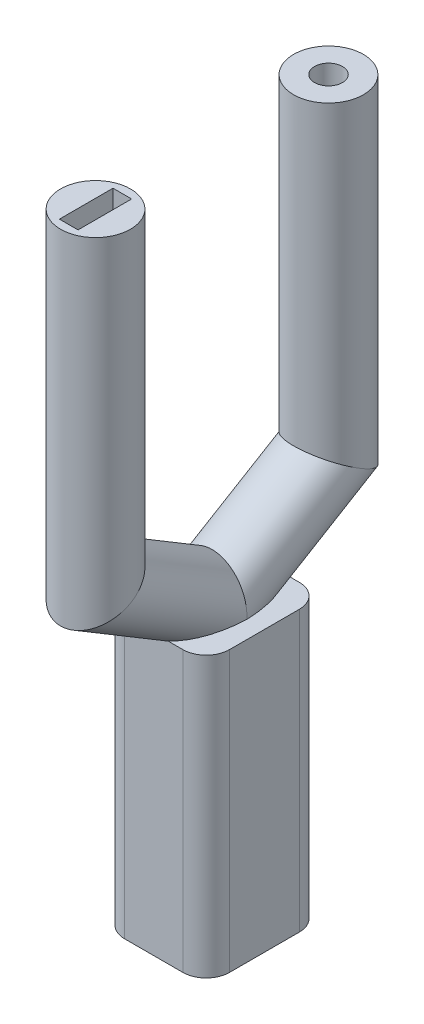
ISO-10303-21;
HEADER;
FILE_DESCRIPTION(('STEP AP214'),'2;1');
FILE_NAME('part.step','',(''),(''),'','','');
FILE_SCHEMA(('AUTOMOTIVE_DESIGN { 1 0 10303 214 1 1 1 1 }'));
ENDSEC;
DATA;
#1=APPLICATION_CONTEXT('core data for automotive mechanical design processes');
#2=APPLICATION_PROTOCOL_DEFINITION('international standard','automotive_design',2000,#1);
#3=PRODUCT_CONTEXT('',#1,'mechanical');
#4=PRODUCT('Part','Part','',(#3));
#5=PRODUCT_RELATED_PRODUCT_CATEGORY('part','',(#4));
#6=PRODUCT_DEFINITION_FORMATION('','',#4);
#7=PRODUCT_DEFINITION_CONTEXT('part definition',#1,'design');
#8=PRODUCT_DEFINITION('design','',#6,#7);
#9=PRODUCT_DEFINITION_SHAPE('','',#8);
#10=(LENGTH_UNIT() NAMED_UNIT(*) SI_UNIT(.MILLI.,.METRE.));
#11=(NAMED_UNIT(*) PLANE_ANGLE_UNIT() SI_UNIT($,.RADIAN.));
#12=(NAMED_UNIT(*) SI_UNIT($,.STERADIAN.) SOLID_ANGLE_UNIT());
#13=UNCERTAINTY_MEASURE_WITH_UNIT(LENGTH_MEASURE(1.E-05),#10,'distance_accuracy_value','');
#14=(GEOMETRIC_REPRESENTATION_CONTEXT(3) GLOBAL_UNCERTAINTY_ASSIGNED_CONTEXT((#13)) GLOBAL_UNIT_ASSIGNED_CONTEXT((#10,
#11,#12)) REPRESENTATION_CONTEXT('',''));
#15=CARTESIAN_POINT('',(0.,0.,0.));
#16=DIRECTION('',(0.,0.,1.));
#17=DIRECTION('',(1.,0.,0.));
#18=AXIS2_PLACEMENT_3D('',#15,#16,#17);
#19=CARTESIAN_POINT('',(-19.5,-290.,-25.));
#20=DIRECTION('',(1.,0.,0.));
#21=DIRECTION('',(0.,0.,-1.));
#22=AXIS2_PLACEMENT_3D('',#19,#20,#21);
#23=PLANE('',#22);
#24=DIRECTION('',(0.,1.,0.));
#25=VECTOR('',#24,1.);
#26=CARTESIAN_POINT('',(-19.5,-290.,-35.));
#27=LINE('',#26,#25);
#28=CARTESIAN_POINT('',(-19.5,-287.,-35.));
#29=VERTEX_POINT('',#28);
#30=CARTESIAN_POINT('',(-19.5,-173.,-35.));
#31=VERTEX_POINT('',#30);
#32=EDGE_CURVE('E829',#29,#31,#27,.T.);
#33=ORIENTED_EDGE('',*,*,#32,.F.);
#34=DIRECTION('',(0.,0.,-1.));
#35=VECTOR('',#34,1.);
#36=CARTESIAN_POINT('',(-19.5,-287.,-25.));
#37=LINE('',#36,#35);
#38=CARTESIAN_POINT('',(-19.5,-287.,-65.));
#39=VERTEX_POINT('',#38);
#40=EDGE_CURVE('E298',#29,#39,#37,.T.);
#41=ORIENTED_EDGE('',*,*,#40,.T.);
#42=DIRECTION('',(0.,1.,0.));
#43=VECTOR('',#42,1.);
#44=CARTESIAN_POINT('',(-19.5,-290.,-65.));
#45=LINE('',#44,#43);
#46=CARTESIAN_POINT('',(-19.5,-173.,-65.));
#47=VERTEX_POINT('',#46);
#48=EDGE_CURVE('E833',#47,#39,#45,.F.);
#49=ORIENTED_EDGE('',*,*,#48,.F.);
#50=DIRECTION('',(0.,0.,-1.));
#51=VECTOR('',#50,1.);
#52=CARTESIAN_POINT('',(-19.5,-173.,-25.));
#53=LINE('',#52,#51);
#54=EDGE_CURVE('E739',#31,#47,#53,.T.);
#55=ORIENTED_EDGE('',*,*,#54,.F.);
#56=EDGE_LOOP('',(#33,#41,#49,#55));
#57=FACE_BOUND('',#56,.T.);
#58=ADVANCED_FACE('F56',(#57),#23,.T.);
#59=CARTESIAN_POINT('',(-22.5,-290.,-72.));
#60=DIRECTION('',(0.,0.,1.));
#61=DIRECTION('',(1.,0.,0.));
#62=AXIS2_PLACEMENT_3D('',#59,#60,#61);
#63=PLANE('',#62);
#64=DIRECTION('',(0.,1.,0.));
#65=VECTOR('',#64,1.);
#66=CARTESIAN_POINT('',(-12.5,-290.,-72.));
#67=LINE('',#66,#65);
#68=CARTESIAN_POINT('',(-12.5,-287.,-72.));
#69=VERTEX_POINT('',#68);
#70=CARTESIAN_POINT('',(-12.5,-173.,-72.));
#71=VERTEX_POINT('',#70);
#72=EDGE_CURVE('E838',#69,#71,#67,.T.);
#73=ORIENTED_EDGE('',*,*,#72,.F.);
#74=DIRECTION('',(1.,0.,0.));
#75=VECTOR('',#74,1.);
#76=CARTESIAN_POINT('',(-22.5,-287.,-72.));
#77=LINE('',#76,#75);
#78=CARTESIAN_POINT('',(12.5,-287.,-72.));
#79=VERTEX_POINT('',#78);
#80=EDGE_CURVE('E74',#69,#79,#77,.T.);
#81=ORIENTED_EDGE('',*,*,#80,.T.);
#82=DIRECTION('',(0.,1.,0.));
#83=VECTOR('',#82,1.);
#84=CARTESIAN_POINT('',(12.5,-290.,-72.));
#85=LINE('',#84,#83);
#86=CARTESIAN_POINT('',(12.5,-173.,-72.));
#87=VERTEX_POINT('',#86);
#88=EDGE_CURVE('E290',#87,#79,#85,.F.);
#89=ORIENTED_EDGE('',*,*,#88,.F.);
#90=DIRECTION('',(1.,0.,0.));
#91=VECTOR('',#90,1.);
#92=CARTESIAN_POINT('',(-22.5,-173.,-72.));
#93=LINE('',#92,#91);
#94=EDGE_CURVE('E742',#71,#87,#93,.T.);
#95=ORIENTED_EDGE('',*,*,#94,.F.);
#96=EDGE_LOOP('',(#73,#81,#89,#95));
#97=FACE_BOUND('',#96,.T.);
#98=ADVANCED_FACE('F404',(#97),#63,.T.);
#99=CARTESIAN_POINT('',(19.5,-290.,-25.));
#100=DIRECTION('',(1.,0.,0.));
#101=DIRECTION('',(0.,0.,-1.));
#102=AXIS2_PLACEMENT_3D('',#99,#100,#101);
#103=PLANE('',#102);
#104=DIRECTION('',(0.,0.,-1.));
#105=VECTOR('',#104,1.);
#106=CARTESIAN_POINT('',(19.5,-287.,-25.));
#107=LINE('',#106,#105);
#108=CARTESIAN_POINT('',(19.5,-287.,-35.));
#109=VERTEX_POINT('',#108);
#110=CARTESIAN_POINT('',(19.5,-287.,-65.));
#111=VERTEX_POINT('',#110);
#112=EDGE_CURVE('E317',#109,#111,#107,.T.);
#113=ORIENTED_EDGE('',*,*,#112,.F.);
#114=DIRECTION('',(0.,1.,0.));
#115=VECTOR('',#114,1.);
#116=CARTESIAN_POINT('',(19.5,-290.,-35.));
#117=LINE('',#116,#115);
#118=CARTESIAN_POINT('',(19.5,-173.,-35.));
#119=VERTEX_POINT('',#118);
#120=EDGE_CURVE('E805',#119,#109,#117,.F.);
#121=ORIENTED_EDGE('',*,*,#120,.F.);
#122=DIRECTION('',(0.,0.,-1.));
#123=VECTOR('',#122,1.);
#124=CARTESIAN_POINT('',(19.5,-173.,-25.));
#125=LINE('',#124,#123);
#126=CARTESIAN_POINT('',(19.5,-173.,-65.));
#127=VERTEX_POINT('',#126);
#128=EDGE_CURVE('E830',#119,#127,#125,.T.);
#129=ORIENTED_EDGE('',*,*,#128,.T.);
#130=DIRECTION('',(0.,1.,0.));
#131=VECTOR('',#130,1.);
#132=CARTESIAN_POINT('',(19.5,-290.,-65.));
#133=LINE('',#132,#131);
#134=EDGE_CURVE('E860',#111,#127,#133,.T.);
#135=ORIENTED_EDGE('',*,*,#134,.F.);
#136=EDGE_LOOP('',(#113,#121,#129,#135));
#137=FACE_BOUND('',#136,.T.);
#138=ADVANCED_FACE('F410',(#137),#103,.F.);
#139=CARTESIAN_POINT('',(-22.5,-290.,-28.));
#140=DIRECTION('',(0.,0.,1.));
#141=DIRECTION('',(1.,0.,0.));
#142=AXIS2_PLACEMENT_3D('',#139,#140,#141);
#143=PLANE('',#142);
#144=DIRECTION('',(1.,0.,0.));
#145=VECTOR('',#144,1.);
#146=CARTESIAN_POINT('',(-22.5,-287.,-28.));
#147=LINE('',#146,#145);
#148=CARTESIAN_POINT('',(-12.5,-287.,-28.));
#149=VERTEX_POINT('',#148);
#150=CARTESIAN_POINT('',(12.5,-287.,-28.));
#151=VERTEX_POINT('',#150);
#152=EDGE_CURVE('E293',#149,#151,#147,.T.);
#153=ORIENTED_EDGE('',*,*,#152,.F.);
#154=DIRECTION('',(0.,1.,0.));
#155=VECTOR('',#154,1.);
#156=CARTESIAN_POINT('',(-12.5,-290.,-28.));
#157=LINE('',#156,#155);
#158=CARTESIAN_POINT('',(-12.5,-173.,-28.));
#159=VERTEX_POINT('',#158);
#160=EDGE_CURVE('E280',#159,#149,#157,.F.);
#161=ORIENTED_EDGE('',*,*,#160,.F.);
#162=DIRECTION('',(1.,0.,0.));
#163=VECTOR('',#162,1.);
#164=CARTESIAN_POINT('',(-22.5,-173.,-28.));
#165=LINE('',#164,#163);
#166=CARTESIAN_POINT('',(12.5,-173.,-28.));
#167=VERTEX_POINT('',#166);
#168=EDGE_CURVE('E813',#159,#167,#165,.T.);
#169=ORIENTED_EDGE('',*,*,#168,.T.);
#170=DIRECTION('',(0.,1.,0.));
#171=VECTOR('',#170,1.);
#172=CARTESIAN_POINT('',(12.5,-290.,-28.));
#173=LINE('',#172,#171);
#174=EDGE_CURVE('E288',#151,#167,#173,.T.);
#175=ORIENTED_EDGE('',*,*,#174,.F.);
#176=EDGE_LOOP('',(#153,#161,#169,#175));
#177=FACE_BOUND('',#176,.T.);
#178=ADVANCED_FACE('F292',(#177),#143,.F.);
#179=CARTESIAN_POINT('',(12.5,-290.,-65.));
#180=DIRECTION('',(0.,-1.,0.));
#181=DIRECTION('',(0.,0.,-1.));
#182=AXIS2_PLACEMENT_3D('',#179,#180,#181);
#183=CYLINDRICAL_SURFACE('',#182,7.);
#184=CARTESIAN_POINT('',(12.5,-287.,-65.));
#185=DIRECTION('',(0.,-1.,0.));
#186=DIRECTION('',(0.,0.,-1.));
#187=AXIS2_PLACEMENT_3D('',#184,#185,#186);
#188=CIRCLE('',#187,7.);
#189=EDGE_CURVE('E85',#111,#79,#188,.F.);
#190=ORIENTED_EDGE('',*,*,#189,.F.);
#191=ORIENTED_EDGE('',*,*,#134,.T.);
#192=CARTESIAN_POINT('',(12.5,-173.,-65.));
#193=DIRECTION('',(0.,-1.,0.));
#194=DIRECTION('',(0.,0.,-1.));
#195=AXIS2_PLACEMENT_3D('',#192,#193,#194);
#196=CIRCLE('',#195,7.);
#197=EDGE_CURVE('E841',#127,#87,#196,.F.);
#198=ORIENTED_EDGE('',*,*,#197,.T.);
#199=ORIENTED_EDGE('',*,*,#88,.T.);
#200=EDGE_LOOP('',(#190,#191,#198,#199));
#201=FACE_BOUND('',#200,.T.);
#202=ADVANCED_FACE('F412',(#201),#183,.F.);
#203=CARTESIAN_POINT('',(12.5,-290.,-35.));
#204=DIRECTION('',(0.,1.,0.));
#205=DIRECTION('',(0.,0.,1.));
#206=AXIS2_PLACEMENT_3D('',#203,#204,#205);
#207=CYLINDRICAL_SURFACE('',#206,7.);
#208=CARTESIAN_POINT('',(12.5,-287.,-35.));
#209=DIRECTION('',(0.,-1.,0.));
#210=DIRECTION('',(0.,0.,-1.));
#211=AXIS2_PLACEMENT_3D('',#208,#209,#210);
#212=CIRCLE('',#211,7.);
#213=EDGE_CURVE('E309',#151,#109,#212,.F.);
#214=ORIENTED_EDGE('',*,*,#213,.F.);
#215=ORIENTED_EDGE('',*,*,#174,.T.);
#216=CARTESIAN_POINT('',(12.5,-173.,-35.));
#217=DIRECTION('',(0.,-1.,0.));
#218=DIRECTION('',(0.,0.,-1.));
#219=AXIS2_PLACEMENT_3D('',#216,#217,#218);
#220=CIRCLE('',#219,7.);
#221=EDGE_CURVE('E855',#167,#119,#220,.F.);
#222=ORIENTED_EDGE('',*,*,#221,.T.);
#223=ORIENTED_EDGE('',*,*,#120,.T.);
#224=EDGE_LOOP('',(#214,#215,#222,#223));
#225=FACE_BOUND('',#224,.T.);
#226=ADVANCED_FACE('F418',(#225),#207,.F.);
#227=CARTESIAN_POINT('',(-12.5,-290.,-65.));
#228=DIRECTION('',(0.,1.,0.));
#229=DIRECTION('',(0.,0.,1.));
#230=AXIS2_PLACEMENT_3D('',#227,#228,#229);
#231=CYLINDRICAL_SURFACE('',#230,7.);
#232=CARTESIAN_POINT('',(-12.5,-287.,-65.));
#233=DIRECTION('',(0.,-1.,0.));
#234=DIRECTION('',(0.,0.,-1.));
#235=AXIS2_PLACEMENT_3D('',#232,#233,#234);
#236=CIRCLE('',#235,7.);
#237=EDGE_CURVE('E303',#69,#39,#236,.F.);
#238=ORIENTED_EDGE('',*,*,#237,.F.);
#239=ORIENTED_EDGE('',*,*,#72,.T.);
#240=CARTESIAN_POINT('',(-12.5,-173.,-65.));
#241=DIRECTION('',(0.,-1.,0.));
#242=DIRECTION('',(0.,0.,-1.));
#243=AXIS2_PLACEMENT_3D('',#240,#241,#242);
#244=CIRCLE('',#243,7.);
#245=EDGE_CURVE('E828',#71,#47,#244,.F.);
#246=ORIENTED_EDGE('',*,*,#245,.T.);
#247=ORIENTED_EDGE('',*,*,#48,.T.);
#248=EDGE_LOOP('',(#238,#239,#246,#247));
#249=FACE_BOUND('',#248,.T.);
#250=ADVANCED_FACE('F417',(#249),#231,.F.);
#251=CARTESIAN_POINT('',(-12.5,-290.,-35.));
#252=DIRECTION('',(0.,-1.,0.));
#253=DIRECTION('',(0.,0.,-1.));
#254=AXIS2_PLACEMENT_3D('',#251,#252,#253);
#255=CYLINDRICAL_SURFACE('',#254,7.);
#256=CARTESIAN_POINT('',(-12.5,-287.,-35.));
#257=DIRECTION('',(0.,-1.,0.));
#258=DIRECTION('',(0.,0.,-1.));
#259=AXIS2_PLACEMENT_3D('',#256,#257,#258);
#260=CIRCLE('',#259,7.);
#261=EDGE_CURVE('E12',#29,#149,#260,.F.);
#262=ORIENTED_EDGE('',*,*,#261,.F.);
#263=ORIENTED_EDGE('',*,*,#32,.T.);
#264=CARTESIAN_POINT('',(-12.5,-173.,-35.));
#265=DIRECTION('',(0.,-1.,0.));
#266=DIRECTION('',(0.,0.,-1.));
#267=AXIS2_PLACEMENT_3D('',#264,#265,#266);
#268=CIRCLE('',#267,7.);
#269=EDGE_CURVE('E285',#31,#159,#268,.F.);
#270=ORIENTED_EDGE('',*,*,#269,.T.);
#271=ORIENTED_EDGE('',*,*,#160,.T.);
#272=EDGE_LOOP('',(#262,#263,#270,#271));
#273=FACE_BOUND('',#272,.T.);
#274=ADVANCED_FACE('F279',(#273),#255,.F.);
#275=CARTESIAN_POINT('',(0.,-174.144957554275,-41.4250707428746));
#276=DIRECTION('',(0.,0.514495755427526,-0.857492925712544));
#277=DIRECTION('',(0.,0.857492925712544,0.514495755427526));
#278=AXIS2_PLACEMENT_3D('',#275,#276,#277);
#279=CYLINDRICAL_SURFACE('',#278,15.);
#280=CARTESIAN_POINT('',(0.,-139.,-100.));
#281=DIRECTION('',(0.,0.870199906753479,-0.492698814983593));
#282=DIRECTION('',(0.,-0.492698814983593,-0.870199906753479));
#283=AXIS2_PLACEMENT_3D('',#280,#281,#282);
#284=ELLIPSE('',#283,17.2374185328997,15.);
#285=CARTESIAN_POINT('',(0.,-147.492855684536,-115.));
#286=VERTEX_POINT('',#285);
#287=EDGE_CURVE('E661',#286,#286,#284,.F.);
#288=ORIENTED_EDGE('',*,*,#287,.T.);
#289=EDGE_LOOP('',(#288));
#290=FACE_BOUND('',#289,.T.);
#291=CARTESIAN_POINT('',(0.,-154.,-75.));
#292=DIRECTION('',(0.,0.,1.));
#293=DIRECTION('',(0.,1.,0.));
#294=AXIS2_PLACEMENT_3D('',#291,#292,#293);
#295=ELLIPSE('',#294,17.4928556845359,15.);
#296=CARTESIAN_POINT('',(6.06339062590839,-170.,-75.));
#297=VERTEX_POINT('',#296);
#298=CARTESIAN_POINT('',(-6.06339062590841,-170.,-75.));
#299=VERTEX_POINT('',#298);
#300=EDGE_CURVE('E682',#297,#299,#295,.F.);
#301=ORIENTED_EDGE('',*,*,#300,.T.);
#302=CARTESIAN_POINT('',(0.,-170.,-48.3333333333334));
#303=DIRECTION('',(0.,-1.,0.));
#304=DIRECTION('',(0.,0.,-1.));
#305=AXIS2_PLACEMENT_3D('',#302,#303,#304);
#306=ELLIPSE('',#305,29.1547594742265,15.);
#307=CARTESIAN_POINT('',(-14.9754701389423,-170.,-50.));
#308=VERTEX_POINT('',#307);
#309=EDGE_CURVE('E553',#299,#308,#306,.F.);
#310=ORIENTED_EDGE('',*,*,#309,.T.);
#311=CARTESIAN_POINT('',(0.,-169.,-50.));
#312=DIRECTION('',(0.,0.,-1.));
#313=DIRECTION('',(0.,-1.,0.));
#314=AXIS2_PLACEMENT_3D('',#311,#312,#313);
#315=ELLIPSE('',#314,17.4928556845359,15.);
#316=CARTESIAN_POINT('',(14.9754701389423,-170.,-50.));
#317=VERTEX_POINT('',#316);
#318=EDGE_CURVE('E654',#317,#308,#315,.F.);
#319=ORIENTED_EDGE('',*,*,#318,.F.);
#320=EDGE_CURVE('E578',#317,#297,#306,.F.);
#321=ORIENTED_EDGE('',*,*,#320,.T.);
#322=EDGE_LOOP('',(#301,#310,#319,#321));
#323=FACE_BOUND('',#322,.T.);
#324=ADVANCED_FACE('F428',(#290,#323),#279,.T.);
#325=CARTESIAN_POINT('',(0.,-134.14205840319,8.09656932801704));
#326=DIRECTION('',(0.,-0.514495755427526,-0.857492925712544));
#327=DIRECTION('',(0.,0.857492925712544,-0.514495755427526));
#328=AXIS2_PLACEMENT_3D('',#325,#326,#327);
#329=CYLINDRICAL_SURFACE('',#328,15.);
#330=CARTESIAN_POINT('',(0.,-139.,0.));
#331=DIRECTION('',(0.,-0.870199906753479,-0.492698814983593));
#332=DIRECTION('',(0.,-0.492698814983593,0.870199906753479));
#333=AXIS2_PLACEMENT_3D('',#330,#331,#332);
#334=ELLIPSE('',#333,17.2374185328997,15.);
#335=CARTESIAN_POINT('',(0.,-147.492855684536,15.));
#336=VERTEX_POINT('',#335);
#337=EDGE_CURVE('E653',#336,#336,#334,.F.);
#338=ORIENTED_EDGE('',*,*,#337,.F.);
#339=EDGE_LOOP('',(#338));
#340=FACE_BOUND('',#339,.T.);
#341=ORIENTED_EDGE('',*,*,#318,.T.);
#342=CARTESIAN_POINT('',(0.,-170.,-51.6666666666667));
#343=DIRECTION('',(0.,-1.,0.));
#344=DIRECTION('',(0.,0.,-1.));
#345=AXIS2_PLACEMENT_3D('',#342,#343,#344);
#346=ELLIPSE('',#345,29.1547594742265,15.);
#347=CARTESIAN_POINT('',(-6.06339062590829,-170.,-25.));
#348=VERTEX_POINT('',#347);
#349=EDGE_CURVE('E583',#308,#348,#346,.F.);
#350=ORIENTED_EDGE('',*,*,#349,.T.);
#351=CARTESIAN_POINT('',(0.,-154.,-25.));
#352=DIRECTION('',(0.,0.,1.));
#353=DIRECTION('',(0.,-1.,0.));
#354=AXIS2_PLACEMENT_3D('',#351,#352,#353);
#355=ELLIPSE('',#354,17.4928556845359,15.);
#356=CARTESIAN_POINT('',(6.06339062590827,-170.,-25.));
#357=VERTEX_POINT('',#356);
#358=EDGE_CURVE('E676',#357,#348,#355,.F.);
#359=ORIENTED_EDGE('',*,*,#358,.F.);
#360=EDGE_CURVE('E574',#357,#317,#346,.F.);
#361=ORIENTED_EDGE('',*,*,#360,.T.);
#362=EDGE_LOOP('',(#341,#350,#359,#361));
#363=FACE_BOUND('',#362,.T.);
#364=ADVANCED_FACE('F466',(#340,#363),#329,.T.);
#365=CARTESIAN_POINT('',(0.,-169.900367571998,-48.4993873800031));
#366=DIRECTION('',(0.,0.514495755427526,-0.857492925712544));
#367=DIRECTION('',(0.,0.857492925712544,0.514495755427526));
#368=AXIS2_PLACEMENT_3D('',#365,#366,#367);
#369=CYLINDRICAL_SURFACE('',#368,2.5);
#370=CARTESIAN_POINT('',(0.,-139.,-100.));
#371=DIRECTION('',(0.,0.870199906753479,-0.492698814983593));
#372=DIRECTION('',(0.,-0.492698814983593,-0.870199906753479));
#373=AXIS2_PLACEMENT_3D('',#370,#371,#372);
#374=ELLIPSE('',#373,2.87290308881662,2.5);
#375=CARTESIAN_POINT('',(0.,-140.415475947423,-102.5));
#376=VERTEX_POINT('',#375);
#377=EDGE_CURVE('E592',#376,#376,#374,.F.);
#378=ORIENTED_EDGE('',*,*,#377,.F.);
#379=EDGE_LOOP('',(#378));
#380=FACE_BOUND('',#379,.T.);
#381=CARTESIAN_POINT('',(0.,-170.,-48.3333333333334));
#382=DIRECTION('',(0.,-1.,0.));
#383=DIRECTION('',(0.,0.,-1.));
#384=AXIS2_PLACEMENT_3D('',#381,#382,#383);
#385=ELLIPSE('',#384,4.85912657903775,2.5);
#386=CARTESIAN_POINT('',(2.3483410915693,-170.,-50.));
#387=VERTEX_POINT('',#386);
#388=CARTESIAN_POINT('',(-2.3483410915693,-170.,-50.));
#389=VERTEX_POINT('',#388);
#390=EDGE_CURVE('E571',#387,#389,#385,.F.);
#391=ORIENTED_EDGE('',*,*,#390,.F.);
#392=CARTESIAN_POINT('',(0.,-169.,-50.));
#393=DIRECTION('',(0.,0.,-1.));
#394=DIRECTION('',(0.,-1.,0.));
#395=AXIS2_PLACEMENT_3D('',#392,#393,#394);
#396=ELLIPSE('',#395,2.91547594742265,2.5);
#397=EDGE_CURVE('E589',#387,#389,#396,.F.);
#398=ORIENTED_EDGE('',*,*,#397,.T.);
#399=EDGE_LOOP('',(#391,#398));
#400=FACE_BOUND('',#399,.T.);
#401=ADVANCED_FACE('F461',(#380,#400),#369,.F.);
#402=CARTESIAN_POINT('',(0.,-138.147468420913,1.42088596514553));
#403=DIRECTION('',(0.,-0.514495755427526,-0.857492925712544));
#404=DIRECTION('',(0.,0.857492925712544,-0.514495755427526));
#405=AXIS2_PLACEMENT_3D('',#402,#403,#404);
#406=CYLINDRICAL_SURFACE('',#405,2.5);
#407=CARTESIAN_POINT('',(0.,-139.,0.));
#408=DIRECTION('',(0.,-0.870199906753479,-0.492698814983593));
#409=DIRECTION('',(0.,-0.492698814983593,0.870199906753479));
#410=AXIS2_PLACEMENT_3D('',#407,#408,#409);
#411=ELLIPSE('',#410,2.87290308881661,2.5);
#412=CARTESIAN_POINT('',(0.,-140.415475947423,2.49999999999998));
#413=VERTEX_POINT('',#412);
#414=EDGE_CURVE('E582',#413,#413,#411,.F.);
#415=ORIENTED_EDGE('',*,*,#414,.T.);
#416=EDGE_LOOP('',(#415));
#417=FACE_BOUND('',#416,.T.);
#418=CARTESIAN_POINT('',(0.,-170.,-51.6666666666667));
#419=DIRECTION('',(0.,-1.,0.));
#420=DIRECTION('',(0.,0.,-1.));
#421=AXIS2_PLACEMENT_3D('',#418,#419,#420);
#422=ELLIPSE('',#421,4.85912657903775,2.5);
#423=EDGE_CURVE('E657',#389,#387,#422,.F.);
#424=ORIENTED_EDGE('',*,*,#423,.F.);
#425=ORIENTED_EDGE('',*,*,#397,.F.);
#426=EDGE_LOOP('',(#424,#425));
#427=FACE_BOUND('',#426,.T.);
#428=ADVANCED_FACE('F458',(#417,#427),#406,.F.);
#429=CARTESIAN_POINT('',(0.,0.,-100.));
#430=DIRECTION('',(0.,1.,0.));
#431=DIRECTION('',(0.,0.,1.));
#432=AXIS2_PLACEMENT_3D('',#429,#430,#431);
#433=PLANE('',#432);
#434=CARTESIAN_POINT('',(0.,0.,-100.));
#435=DIRECTION('',(0.,1.,0.));
#436=DIRECTION('',(0.,0.,1.));
#437=AXIS2_PLACEMENT_3D('',#434,#435,#436);
#438=CIRCLE('',#437,6.);
#439=CARTESIAN_POINT('',(0.,0.,-94.));
#440=VERTEX_POINT('',#439);
#441=EDGE_CURVE('E635',#440,#440,#438,.T.);
#442=ORIENTED_EDGE('',*,*,#441,.F.);
#443=EDGE_LOOP('',(#442));
#444=FACE_BOUND('',#443,.T.);
#445=CARTESIAN_POINT('',(0.,0.,-100.));
#446=DIRECTION('',(0.,1.,0.));
#447=DIRECTION('',(0.,0.,1.));
#448=AXIS2_PLACEMENT_3D('',#445,#446,#447);
#449=CIRCLE('',#448,15.);
#450=CARTESIAN_POINT('',(0.,0.,-85.));
#451=VERTEX_POINT('',#450);
#452=EDGE_CURVE('E648',#451,#451,#449,.T.);
#453=ORIENTED_EDGE('',*,*,#452,.T.);
#454=EDGE_LOOP('',(#453));
#455=FACE_BOUND('',#454,.T.);
#456=ADVANCED_FACE('F465',(#444,#455),#433,.T.);
#457=CARTESIAN_POINT('',(0.,0.,0.));
#458=DIRECTION('',(0.,-1.,0.));
#459=DIRECTION('',(0.,0.,-1.));
#460=AXIS2_PLACEMENT_3D('',#457,#458,#459);
#461=PLANE('',#460);
#462=DIRECTION('',(0.,0.,-1.));
#463=VECTOR('',#462,1.);
#464=CARTESIAN_POINT('',(-4.,0.,11.5));
#465=LINE('',#464,#463);
#466=CARTESIAN_POINT('',(-4.,0.,11.5));
#467=VERTEX_POINT('',#466);
#468=CARTESIAN_POINT('',(-4.,0.,-11.5));
#469=VERTEX_POINT('',#468);
#470=EDGE_CURVE('E617',#467,#469,#465,.T.);
#471=ORIENTED_EDGE('',*,*,#470,.T.);
#472=DIRECTION('',(-1.,0.,0.));
#473=VECTOR('',#472,1.);
#474=CARTESIAN_POINT('',(4.,0.,-11.5));
#475=LINE('',#474,#473);
#476=CARTESIAN_POINT('',(4.,0.,-11.5));
#477=VERTEX_POINT('',#476);
#478=EDGE_CURVE('E612',#477,#469,#475,.T.);
#479=ORIENTED_EDGE('',*,*,#478,.F.);
#480=DIRECTION('',(0.,0.,-1.));
#481=VECTOR('',#480,1.);
#482=CARTESIAN_POINT('',(4.,0.,11.5));
#483=LINE('',#482,#481);
#484=CARTESIAN_POINT('',(4.,0.,11.5));
#485=VERTEX_POINT('',#484);
#486=EDGE_CURVE('E601',#485,#477,#483,.T.);
#487=ORIENTED_EDGE('',*,*,#486,.F.);
#488=DIRECTION('',(-1.,0.,0.));
#489=VECTOR('',#488,1.);
#490=CARTESIAN_POINT('',(4.,0.,11.5));
#491=LINE('',#490,#489);
#492=EDGE_CURVE('E625',#485,#467,#491,.T.);
#493=ORIENTED_EDGE('',*,*,#492,.T.);
#494=EDGE_LOOP('',(#471,#479,#487,#493));
#495=FACE_BOUND('',#494,.T.);
#496=CARTESIAN_POINT('',(0.,0.,0.));
#497=DIRECTION('',(0.,-1.,0.));
#498=DIRECTION('',(0.,0.,-1.));
#499=AXIS2_PLACEMENT_3D('',#496,#497,#498);
#500=CIRCLE('',#499,15.);
#501=CARTESIAN_POINT('',(0.,0.,-15.));
#502=VERTEX_POINT('',#501);
#503=EDGE_CURVE('E647',#502,#502,#500,.T.);
#504=ORIENTED_EDGE('',*,*,#503,.F.);
#505=EDGE_LOOP('',(#504));
#506=FACE_BOUND('',#505,.T.);
#507=ADVANCED_FACE('F515',(#495,#506),#461,.F.);
#508=CARTESIAN_POINT('',(0.,-148.44214125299,-100.));
#509=DIRECTION('',(0.,1.,0.));
#510=DIRECTION('',(0.,0.,1.));
#511=AXIS2_PLACEMENT_3D('',#508,#509,#510);
#512=CYLINDRICAL_SURFACE('',#511,15.);
#513=ORIENTED_EDGE('',*,*,#287,.F.);
#514=EDGE_LOOP('',(#513));
#515=FACE_BOUND('',#514,.T.);
#516=ORIENTED_EDGE('',*,*,#452,.F.);
#517=EDGE_LOOP('',(#516));
#518=FACE_BOUND('',#517,.T.);
#519=ADVANCED_FACE('F505',(#515,#518),#512,.T.);
#520=CARTESIAN_POINT('',(0.,0.,0.));
#521=DIRECTION('',(0.,-1.,0.));
#522=DIRECTION('',(0.,0.,-1.));
#523=AXIS2_PLACEMENT_3D('',#520,#521,#522);
#524=CYLINDRICAL_SURFACE('',#523,15.);
#525=ORIENTED_EDGE('',*,*,#503,.T.);
#526=EDGE_LOOP('',(#525));
#527=FACE_BOUND('',#526,.T.);
#528=ORIENTED_EDGE('',*,*,#337,.T.);
#529=EDGE_LOOP('',(#528));
#530=FACE_BOUND('',#529,.T.);
#531=ADVANCED_FACE('F464',(#527,#530),#524,.T.);
#532=CARTESIAN_POINT('',(0.,-129.,-100.));
#533=DIRECTION('',(0.,1.,0.));
#534=DIRECTION('',(0.,0.,1.));
#535=AXIS2_PLACEMENT_3D('',#532,#533,#534);
#536=CYLINDRICAL_SURFACE('',#535,6.);
#537=CARTESIAN_POINT('',(0.,-129.,-100.));
#538=DIRECTION('',(0.,1.,0.));
#539=DIRECTION('',(0.,0.,1.));
#540=AXIS2_PLACEMENT_3D('',#537,#538,#539);
#541=CIRCLE('',#540,6.);
#542=CARTESIAN_POINT('',(0.,-129.,-94.));
#543=VERTEX_POINT('',#542);
#544=EDGE_CURVE('E645',#543,#543,#541,.T.);
#545=ORIENTED_EDGE('',*,*,#544,.F.);
#546=EDGE_LOOP('',(#545));
#547=FACE_BOUND('',#546,.T.);
#548=ORIENTED_EDGE('',*,*,#441,.T.);
#549=EDGE_LOOP('',(#548));
#550=FACE_BOUND('',#549,.T.);
#551=ADVANCED_FACE('F492',(#547,#550),#536,.F.);
#552=CARTESIAN_POINT('',(0.,-129.,-100.));
#553=DIRECTION('',(0.,1.,0.));
#554=DIRECTION('',(0.,0.,1.));
#555=AXIS2_PLACEMENT_3D('',#552,#553,#554);
#556=PLANE('',#555);
#557=CARTESIAN_POINT('',(0.,-129.,-100.));
#558=DIRECTION('',(0.,1.,0.));
#559=DIRECTION('',(0.,0.,1.));
#560=AXIS2_PLACEMENT_3D('',#557,#558,#559);
#561=CIRCLE('',#560,2.5);
#562=CARTESIAN_POINT('',(0.,-129.,-97.5));
#563=VERTEX_POINT('',#562);
#564=EDGE_CURVE('E616',#563,#563,#561,.T.);
#565=ORIENTED_EDGE('',*,*,#564,.F.);
#566=EDGE_LOOP('',(#565));
#567=FACE_BOUND('',#566,.T.);
#568=ORIENTED_EDGE('',*,*,#544,.T.);
#569=EDGE_LOOP('',(#568));
#570=FACE_BOUND('',#569,.T.);
#571=ADVANCED_FACE('F493',(#567,#570),#556,.T.);
#572=CARTESIAN_POINT('',(4.,-42.,-11.5));
#573=DIRECTION('',(0.,0.,-1.));
#574=DIRECTION('',(-1.,0.,0.));
#575=AXIS2_PLACEMENT_3D('',#572,#573,#574);
#576=PLANE('',#575);
#577=ORIENTED_EDGE('',*,*,#478,.T.);
#578=DIRECTION('',(0.,1.,0.));
#579=VECTOR('',#578,1.);
#580=CARTESIAN_POINT('',(-4.,-42.,-11.5));
#581=LINE('',#580,#579);
#582=CARTESIAN_POINT('',(-4.,-42.,-11.5));
#583=VERTEX_POINT('',#582);
#584=EDGE_CURVE('E611',#583,#469,#581,.T.);
#585=ORIENTED_EDGE('',*,*,#584,.F.);
#586=DIRECTION('',(-1.,0.,0.));
#587=VECTOR('',#586,1.);
#588=CARTESIAN_POINT('',(4.,-42.,-11.5));
#589=LINE('',#588,#587);
#590=CARTESIAN_POINT('',(4.,-42.,-11.5));
#591=VERTEX_POINT('',#590);
#592=EDGE_CURVE('E596',#591,#583,#589,.T.);
#593=ORIENTED_EDGE('',*,*,#592,.F.);
#594=DIRECTION('',(0.,1.,0.));
#595=VECTOR('',#594,1.);
#596=CARTESIAN_POINT('',(4.,-42.,-11.5));
#597=LINE('',#596,#595);
#598=EDGE_CURVE('E627',#591,#477,#597,.T.);
#599=ORIENTED_EDGE('',*,*,#598,.T.);
#600=EDGE_LOOP('',(#577,#585,#593,#599));
#601=FACE_BOUND('',#600,.T.);
#602=ADVANCED_FACE('F483',(#601),#576,.F.);
#603=CARTESIAN_POINT('',(4.,-42.,11.5));
#604=DIRECTION('',(1.,0.,0.));
#605=DIRECTION('',(0.,0.,-1.));
#606=AXIS2_PLACEMENT_3D('',#603,#604,#605);
#607=PLANE('',#606);
#608=ORIENTED_EDGE('',*,*,#486,.T.);
#609=ORIENTED_EDGE('',*,*,#598,.F.);
#610=DIRECTION('',(0.,0.,-1.));
#611=VECTOR('',#610,1.);
#612=CARTESIAN_POINT('',(4.,-42.,11.5));
#613=LINE('',#612,#611);
#614=CARTESIAN_POINT('',(4.,-42.,11.5));
#615=VERTEX_POINT('',#614);
#616=EDGE_CURVE('E608',#615,#591,#613,.T.);
#617=ORIENTED_EDGE('',*,*,#616,.F.);
#618=DIRECTION('',(0.,1.,0.));
#619=VECTOR('',#618,1.);
#620=CARTESIAN_POINT('',(4.,-42.,11.5));
#621=LINE('',#620,#619);
#622=EDGE_CURVE('E633',#615,#485,#621,.T.);
#623=ORIENTED_EDGE('',*,*,#622,.T.);
#624=EDGE_LOOP('',(#608,#609,#617,#623));
#625=FACE_BOUND('',#624,.T.);
#626=ADVANCED_FACE('F480',(#625),#607,.F.);
#627=CARTESIAN_POINT('',(4.,-42.,11.5));
#628=DIRECTION('',(0.,0.,-1.));
#629=DIRECTION('',(0.,1.,0.));
#630=AXIS2_PLACEMENT_3D('',#627,#628,#629);
#631=PLANE('',#630);
#632=ORIENTED_EDGE('',*,*,#492,.F.);
#633=ORIENTED_EDGE('',*,*,#622,.F.);
#634=DIRECTION('',(-1.,0.,0.));
#635=VECTOR('',#634,1.);
#636=CARTESIAN_POINT('',(4.,-42.,11.5));
#637=LINE('',#636,#635);
#638=CARTESIAN_POINT('',(-4.,-42.,11.5));
#639=VERTEX_POINT('',#638);
#640=EDGE_CURVE('E606',#615,#639,#637,.T.);
#641=ORIENTED_EDGE('',*,*,#640,.T.);
#642=DIRECTION('',(0.,1.,0.));
#643=VECTOR('',#642,1.);
#644=CARTESIAN_POINT('',(-4.,-42.,11.5));
#645=LINE('',#644,#643);
#646=EDGE_CURVE('E636',#639,#467,#645,.T.);
#647=ORIENTED_EDGE('',*,*,#646,.T.);
#648=EDGE_LOOP('',(#632,#633,#641,#647));
#649=FACE_BOUND('',#648,.T.);
#650=ADVANCED_FACE('F479',(#649),#631,.T.);
#651=CARTESIAN_POINT('',(-4.,-42.,11.5));
#652=DIRECTION('',(1.,0.,0.));
#653=DIRECTION('',(0.,0.,-1.));
#654=AXIS2_PLACEMENT_3D('',#651,#652,#653);
#655=PLANE('',#654);
#656=ORIENTED_EDGE('',*,*,#470,.F.);
#657=ORIENTED_EDGE('',*,*,#646,.F.);
#658=DIRECTION('',(0.,0.,-1.));
#659=VECTOR('',#658,1.);
#660=CARTESIAN_POINT('',(-4.,-42.,11.5));
#661=LINE('',#660,#659);
#662=EDGE_CURVE('E605',#639,#583,#661,.T.);
#663=ORIENTED_EDGE('',*,*,#662,.T.);
#664=ORIENTED_EDGE('',*,*,#584,.T.);
#665=EDGE_LOOP('',(#656,#657,#663,#664));
#666=FACE_BOUND('',#665,.T.);
#667=ADVANCED_FACE('F472',(#666),#655,.T.);
#668=CARTESIAN_POINT('',(0.,-42.,0.));
#669=DIRECTION('',(0.,-1.,0.));
#670=DIRECTION('',(0.,0.,-1.));
#671=AXIS2_PLACEMENT_3D('',#668,#669,#670);
#672=PLANE('',#671);
#673=CARTESIAN_POINT('',(0.,-42.,0.));
#674=DIRECTION('',(0.,-1.,0.));
#675=DIRECTION('',(0.,0.,-1.));
#676=AXIS2_PLACEMENT_3D('',#673,#674,#675);
#677=CIRCLE('',#676,2.5);
#678=CARTESIAN_POINT('',(0.,-42.,-2.50000000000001));
#679=VERTEX_POINT('',#678);
#680=EDGE_CURVE('E588',#679,#679,#677,.T.);
#681=ORIENTED_EDGE('',*,*,#680,.T.);
#682=EDGE_LOOP('',(#681));
#683=FACE_BOUND('',#682,.T.);
#684=ORIENTED_EDGE('',*,*,#592,.T.);
#685=ORIENTED_EDGE('',*,*,#662,.F.);
#686=ORIENTED_EDGE('',*,*,#640,.F.);
#687=ORIENTED_EDGE('',*,*,#616,.T.);
#688=EDGE_LOOP('',(#684,#685,#686,#687));
#689=FACE_BOUND('',#688,.T.);
#690=ADVANCED_FACE('F460',(#683,#689),#672,.F.);
#691=CARTESIAN_POINT('',(0.,0.,0.));
#692=DIRECTION('',(0.,-1.,0.));
#693=DIRECTION('',(0.,0.,-1.));
#694=AXIS2_PLACEMENT_3D('',#691,#692,#693);
#695=CYLINDRICAL_SURFACE('',#694,2.5);
#696=ORIENTED_EDGE('',*,*,#414,.F.);
#697=EDGE_LOOP('',(#696));
#698=FACE_BOUND('',#697,.T.);
#699=ORIENTED_EDGE('',*,*,#680,.F.);
#700=EDGE_LOOP('',(#699));
#701=FACE_BOUND('',#700,.T.);
#702=ADVANCED_FACE('F451',(#698,#701),#695,.F.);
#703=CARTESIAN_POINT('',(0.,-140.657023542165,-100.));
#704=DIRECTION('',(0.,1.,0.));
#705=DIRECTION('',(0.,0.,1.));
#706=AXIS2_PLACEMENT_3D('',#703,#704,#705);
#707=CYLINDRICAL_SURFACE('',#706,2.5);
#708=ORIENTED_EDGE('',*,*,#564,.T.);
#709=EDGE_LOOP('',(#708));
#710=FACE_BOUND('',#709,.T.);
#711=ORIENTED_EDGE('',*,*,#377,.T.);
#712=EDGE_LOOP('',(#711));
#713=FACE_BOUND('',#712,.T.);
#714=ADVANCED_FACE('F456',(#710,#713),#707,.F.);
#715=CARTESIAN_POINT('',(0.,-170.,0.));
#716=DIRECTION('',(0.,-1.,0.));
#717=DIRECTION('',(0.,0.,-1.));
#718=AXIS2_PLACEMENT_3D('',#715,#716,#717);
#719=PLANE('',#718);
#720=DIRECTION('',(1.,0.,0.));
#721=VECTOR('',#720,1.);
#722=CARTESIAN_POINT('',(-22.5,-170.,-75.));
#723=LINE('',#722,#721);
#724=CARTESIAN_POINT('',(-12.5,-170.,-75.));
#725=VERTEX_POINT('',#724);
#726=EDGE_CURVE('E547',#725,#299,#723,.T.);
#727=ORIENTED_EDGE('',*,*,#726,.F.);
#728=CARTESIAN_POINT('',(-12.5,-170.,-65.));
#729=DIRECTION('',(0.,-1.,0.));
#730=DIRECTION('',(0.,0.,-1.));
#731=AXIS2_PLACEMENT_3D('',#728,#729,#730);
#732=CIRCLE('',#731,10.);
#733=CARTESIAN_POINT('',(-22.5,-170.,-65.));
#734=VERTEX_POINT('',#733);
#735=EDGE_CURVE('E538',#725,#734,#732,.F.);
#736=ORIENTED_EDGE('',*,*,#735,.T.);
#737=DIRECTION('',(0.,0.,-1.));
#738=VECTOR('',#737,1.);
#739=CARTESIAN_POINT('',(-22.5,-170.,-25.));
#740=LINE('',#739,#738);
#741=CARTESIAN_POINT('',(-22.5,-170.,-35.));
#742=VERTEX_POINT('',#741);
#743=EDGE_CURVE('E563',#742,#734,#740,.T.);
#744=ORIENTED_EDGE('',*,*,#743,.F.);
#745=CARTESIAN_POINT('',(-12.5,-170.,-35.));
#746=DIRECTION('',(0.,-1.,0.));
#747=DIRECTION('',(0.,0.,-1.));
#748=AXIS2_PLACEMENT_3D('',#745,#746,#747);
#749=CIRCLE('',#748,10.);
#750=CARTESIAN_POINT('',(-12.5,-170.,-25.));
#751=VERTEX_POINT('',#750);
#752=EDGE_CURVE('E548',#742,#751,#749,.F.);
#753=ORIENTED_EDGE('',*,*,#752,.T.);
#754=DIRECTION('',(1.,0.,0.));
#755=VECTOR('',#754,1.);
#756=CARTESIAN_POINT('',(-22.5,-170.,-25.));
#757=LINE('',#756,#755);
#758=EDGE_CURVE('E570',#751,#348,#757,.T.);
#759=ORIENTED_EDGE('',*,*,#758,.T.);
#760=ORIENTED_EDGE('',*,*,#349,.F.);
#761=ORIENTED_EDGE('',*,*,#309,.F.);
#762=EDGE_LOOP('',(#727,#736,#744,#753,#759,#760,#761));
#763=FACE_BOUND('',#762,.T.);
#764=ADVANCED_FACE('F440',(#763),#719,.F.);
#765=CARTESIAN_POINT('',(-22.5,-290.,-25.));
#766=DIRECTION('',(1.,0.,0.));
#767=DIRECTION('',(0.,0.,-1.));
#768=AXIS2_PLACEMENT_3D('',#765,#766,#767);
#769=PLANE('',#768);
#770=DIRECTION('',(0.,1.,0.));
#771=VECTOR('',#770,1.);
#772=CARTESIAN_POINT('',(-22.5,-170.,-35.));
#773=LINE('',#772,#771);
#774=CARTESIAN_POINT('',(-22.5,-290.,-35.));
#775=VERTEX_POINT('',#774);
#776=EDGE_CURVE('E544',#775,#742,#773,.T.);
#777=ORIENTED_EDGE('',*,*,#776,.T.);
#778=ORIENTED_EDGE('',*,*,#743,.T.);
#779=DIRECTION('',(0.,1.,0.));
#780=VECTOR('',#779,1.);
#781=CARTESIAN_POINT('',(-22.5,-290.,-65.));
#782=LINE('',#781,#780);
#783=CARTESIAN_POINT('',(-22.5,-290.,-65.));
#784=VERTEX_POINT('',#783);
#785=EDGE_CURVE('E537',#734,#784,#782,.F.);
#786=ORIENTED_EDGE('',*,*,#785,.T.);
#787=DIRECTION('',(0.,0.,-1.));
#788=VECTOR('',#787,1.);
#789=CARTESIAN_POINT('',(-22.5,-290.,-25.));
#790=LINE('',#789,#788);
#791=EDGE_CURVE('E569',#775,#784,#790,.T.);
#792=ORIENTED_EDGE('',*,*,#791,.F.);
#793=EDGE_LOOP('',(#777,#778,#786,#792));
#794=FACE_BOUND('',#793,.T.);
#795=ADVANCED_FACE('F449',(#794),#769,.F.);
#796=CARTESIAN_POINT('',(-22.5,-290.,-75.));
#797=DIRECTION('',(0.,0.,1.));
#798=DIRECTION('',(1.,0.,0.));
#799=AXIS2_PLACEMENT_3D('',#796,#797,#798);
#800=PLANE('',#799);
#801=DIRECTION('',(0.,1.,0.));
#802=VECTOR('',#801,1.);
#803=CARTESIAN_POINT('',(-12.5,-290.,-75.));
#804=LINE('',#803,#802);
#805=CARTESIAN_POINT('',(-12.5,-290.,-75.));
#806=VERTEX_POINT('',#805);
#807=EDGE_CURVE('E539',#806,#725,#804,.T.);
#808=ORIENTED_EDGE('',*,*,#807,.T.);
#809=ORIENTED_EDGE('',*,*,#726,.T.);
#810=ORIENTED_EDGE('',*,*,#300,.F.);
#811=CARTESIAN_POINT('',(12.5,-170.,-75.));
#812=VERTEX_POINT('',#811);
#813=EDGE_CURVE('E554',#297,#812,#723,.T.);
#814=ORIENTED_EDGE('',*,*,#813,.T.);
#815=DIRECTION('',(0.,1.,0.));
#816=VECTOR('',#815,1.);
#817=CARTESIAN_POINT('',(12.5,-290.,-75.));
#818=LINE('',#817,#816);
#819=CARTESIAN_POINT('',(12.5,-290.,-75.));
#820=VERTEX_POINT('',#819);
#821=EDGE_CURVE('E697',#812,#820,#818,.F.);
#822=ORIENTED_EDGE('',*,*,#821,.T.);
#823=DIRECTION('',(1.,0.,0.));
#824=VECTOR('',#823,1.);
#825=CARTESIAN_POINT('',(-22.5,-290.,-75.));
#826=LINE('',#825,#824);
#827=EDGE_CURVE('E882',#806,#820,#826,.T.);
#828=ORIENTED_EDGE('',*,*,#827,.F.);
#829=EDGE_LOOP('',(#808,#809,#810,#814,#822,#828));
#830=FACE_BOUND('',#829,.T.);
#831=ADVANCED_FACE('F443',(#830),#800,.F.);
#832=CARTESIAN_POINT('',(22.5,-290.,-25.));
#833=DIRECTION('',(1.,0.,0.));
#834=DIRECTION('',(0.,0.,-1.));
#835=AXIS2_PLACEMENT_3D('',#832,#833,#834);
#836=PLANE('',#835);
#837=DIRECTION('',(0.,1.,0.));
#838=VECTOR('',#837,1.);
#839=CARTESIAN_POINT('',(22.5,-290.,-35.));
#840=LINE('',#839,#838);
#841=CARTESIAN_POINT('',(22.5,-170.,-35.));
#842=VERTEX_POINT('',#841);
#843=CARTESIAN_POINT('',(22.5,-290.,-35.));
#844=VERTEX_POINT('',#843);
#845=EDGE_CURVE('E684',#842,#844,#840,.F.);
#846=ORIENTED_EDGE('',*,*,#845,.T.);
#847=DIRECTION('',(0.,0.,-1.));
#848=VECTOR('',#847,1.);
#849=CARTESIAN_POINT('',(22.5,-290.,-25.));
#850=LINE('',#849,#848);
#851=CARTESIAN_POINT('',(22.5,-290.,-65.));
#852=VERTEX_POINT('',#851);
#853=EDGE_CURVE('E887',#844,#852,#850,.T.);
#854=ORIENTED_EDGE('',*,*,#853,.T.);
#855=DIRECTION('',(0.,1.,0.));
#856=VECTOR('',#855,1.);
#857=CARTESIAN_POINT('',(22.5,-170.,-65.));
#858=LINE('',#857,#856);
#859=CARTESIAN_POINT('',(22.5,-170.,-65.));
#860=VERTEX_POINT('',#859);
#861=EDGE_CURVE('E686',#852,#860,#858,.T.);
#862=ORIENTED_EDGE('',*,*,#861,.T.);
#863=DIRECTION('',(0.,0.,-1.));
#864=VECTOR('',#863,1.);
#865=CARTESIAN_POINT('',(22.5,-170.,-25.));
#866=LINE('',#865,#864);
#867=EDGE_CURVE('E555',#842,#860,#866,.T.);
#868=ORIENTED_EDGE('',*,*,#867,.F.);
#869=EDGE_LOOP('',(#846,#854,#862,#868));
#870=FACE_BOUND('',#869,.T.);
#871=ADVANCED_FACE('F439',(#870),#836,.T.);
#872=CARTESIAN_POINT('',(-22.5,-290.,-25.));
#873=DIRECTION('',(0.,0.,1.));
#874=DIRECTION('',(1.,0.,0.));
#875=AXIS2_PLACEMENT_3D('',#872,#873,#874);
#876=PLANE('',#875);
#877=DIRECTION('',(0.,1.,0.));
#878=VECTOR('',#877,1.);
#879=CARTESIAN_POINT('',(-12.5,-290.,-25.));
#880=LINE('',#879,#878);
#881=CARTESIAN_POINT('',(-12.5,-290.,-25.));
#882=VERTEX_POINT('',#881);
#883=EDGE_CURVE('E714',#751,#882,#880,.F.);
#884=ORIENTED_EDGE('',*,*,#883,.T.);
#885=DIRECTION('',(1.,0.,0.));
#886=VECTOR('',#885,1.);
#887=CARTESIAN_POINT('',(-22.5,-290.,-25.));
#888=LINE('',#887,#886);
#889=CARTESIAN_POINT('',(12.5,-290.,-25.));
#890=VERTEX_POINT('',#889);
#891=EDGE_CURVE('E577',#882,#890,#888,.T.);
#892=ORIENTED_EDGE('',*,*,#891,.T.);
#893=DIRECTION('',(0.,1.,0.));
#894=VECTOR('',#893,1.);
#895=CARTESIAN_POINT('',(12.5,-290.,-25.));
#896=LINE('',#895,#894);
#897=CARTESIAN_POINT('',(12.5,-170.,-25.));
#898=VERTEX_POINT('',#897);
#899=EDGE_CURVE('E720',#890,#898,#896,.T.);
#900=ORIENTED_EDGE('',*,*,#899,.T.);
#901=EDGE_CURVE('E557',#357,#898,#757,.T.);
#902=ORIENTED_EDGE('',*,*,#901,.F.);
#903=ORIENTED_EDGE('',*,*,#358,.T.);
#904=ORIENTED_EDGE('',*,*,#758,.F.);
#905=EDGE_LOOP('',(#884,#892,#900,#902,#903,#904));
#906=FACE_BOUND('',#905,.T.);
#907=ADVANCED_FACE('F431',(#906),#876,.T.);
#908=CARTESIAN_POINT('',(0.,-290.,0.));
#909=DIRECTION('',(0.,-1.,0.));
#910=DIRECTION('',(0.,0.,-1.));
#911=AXIS2_PLACEMENT_3D('',#908,#909,#910);
#912=PLANE('',#911);
#913=CARTESIAN_POINT('',(-15.5,-290.,-50.));
#914=DIRECTION('',(0.,-1.,0.));
#915=DIRECTION('',(0.,0.,-1.));
#916=AXIS2_PLACEMENT_3D('',#913,#914,#915);
#917=CIRCLE('',#916,2.5);
#918=CARTESIAN_POINT('',(-15.5,-290.,-52.5));
#919=VERTEX_POINT('',#918);
#920=EDGE_CURVE('E1161',#919,#919,#917,.T.);
#921=ORIENTED_EDGE('',*,*,#920,.F.);
#922=EDGE_LOOP('',(#921));
#923=FACE_BOUND('',#922,.T.);
#924=ORIENTED_EDGE('',*,*,#827,.T.);
#925=CARTESIAN_POINT('',(12.5,-290.,-65.));
#926=DIRECTION('',(0.,-1.,0.));
#927=DIRECTION('',(0.,0.,-1.));
#928=AXIS2_PLACEMENT_3D('',#925,#926,#927);
#929=CIRCLE('',#928,10.);
#930=EDGE_CURVE('E713',#820,#852,#929,.T.);
#931=ORIENTED_EDGE('',*,*,#930,.T.);
#932=ORIENTED_EDGE('',*,*,#853,.F.);
#933=CARTESIAN_POINT('',(12.5,-290.,-35.));
#934=DIRECTION('',(0.,-1.,0.));
#935=DIRECTION('',(0.,0.,-1.));
#936=AXIS2_PLACEMENT_3D('',#933,#934,#935);
#937=CIRCLE('',#936,10.);
#938=EDGE_CURVE('E709',#844,#890,#937,.T.);
#939=ORIENTED_EDGE('',*,*,#938,.T.);
#940=ORIENTED_EDGE('',*,*,#891,.F.);
#941=CARTESIAN_POINT('',(-12.5,-290.,-35.));
#942=DIRECTION('',(0.,-1.,0.));
#943=DIRECTION('',(0.,0.,-1.));
#944=AXIS2_PLACEMENT_3D('',#941,#942,#943);
#945=CIRCLE('',#944,10.);
#946=EDGE_CURVE('E705',#882,#775,#945,.T.);
#947=ORIENTED_EDGE('',*,*,#946,.T.);
#948=ORIENTED_EDGE('',*,*,#791,.T.);
#949=CARTESIAN_POINT('',(-12.5,-290.,-65.));
#950=DIRECTION('',(0.,-1.,0.));
#951=DIRECTION('',(0.,0.,-1.));
#952=AXIS2_PLACEMENT_3D('',#949,#950,#951);
#953=CIRCLE('',#952,10.);
#954=EDGE_CURVE('E704',#784,#806,#953,.T.);
#955=ORIENTED_EDGE('',*,*,#954,.T.);
#956=EDGE_LOOP('',(#924,#931,#932,#939,#940,#947,#948,#955));
#957=FACE_BOUND('',#956,.T.);
#958=ADVANCED_FACE('F430',(#923,#957),#912,.T.);
#959=ORIENTED_EDGE('',*,*,#867,.T.);
#960=CARTESIAN_POINT('',(12.5,-170.,-65.));
#961=DIRECTION('',(0.,-1.,0.));
#962=DIRECTION('',(0.,0.,-1.));
#963=AXIS2_PLACEMENT_3D('',#960,#961,#962);
#964=CIRCLE('',#963,10.);
#965=EDGE_CURVE('E692',#860,#812,#964,.F.);
#966=ORIENTED_EDGE('',*,*,#965,.T.);
#967=ORIENTED_EDGE('',*,*,#813,.F.);
#968=ORIENTED_EDGE('',*,*,#320,.F.);
#969=ORIENTED_EDGE('',*,*,#360,.F.);
#970=ORIENTED_EDGE('',*,*,#901,.T.);
#971=CARTESIAN_POINT('',(12.5,-170.,-35.));
#972=DIRECTION('',(0.,-1.,0.));
#973=DIRECTION('',(0.,0.,-1.));
#974=AXIS2_PLACEMENT_3D('',#971,#972,#973);
#975=CIRCLE('',#974,10.);
#976=EDGE_CURVE('E691',#898,#842,#975,.F.);
#977=ORIENTED_EDGE('',*,*,#976,.T.);
#978=EDGE_LOOP('',(#959,#966,#967,#968,#969,#970,#977));
#979=FACE_BOUND('',#978,.T.);
#980=ADVANCED_FACE('F427',(#979),#719,.F.);
#981=CARTESIAN_POINT('',(12.5,-290.,-65.));
#982=DIRECTION('',(0.,-1.,0.));
#983=DIRECTION('',(0.,0.,-1.));
#984=AXIS2_PLACEMENT_3D('',#981,#982,#983);
#985=CYLINDRICAL_SURFACE('',#984,10.);
#986=ORIENTED_EDGE('',*,*,#965,.F.);
#987=ORIENTED_EDGE('',*,*,#861,.F.);
#988=ORIENTED_EDGE('',*,*,#930,.F.);
#989=ORIENTED_EDGE('',*,*,#821,.F.);
#990=EDGE_LOOP('',(#986,#987,#988,#989));
#991=FACE_BOUND('',#990,.T.);
#992=ADVANCED_FACE('F434',(#991),#985,.T.);
#993=CARTESIAN_POINT('',(12.5,-290.,-35.));
#994=DIRECTION('',(0.,1.,0.));
#995=DIRECTION('',(0.,0.,1.));
#996=AXIS2_PLACEMENT_3D('',#993,#994,#995);
#997=CYLINDRICAL_SURFACE('',#996,10.);
#998=ORIENTED_EDGE('',*,*,#976,.F.);
#999=ORIENTED_EDGE('',*,*,#899,.F.);
#1000=ORIENTED_EDGE('',*,*,#938,.F.);
#1001=ORIENTED_EDGE('',*,*,#845,.F.);
#1002=EDGE_LOOP('',(#998,#999,#1000,#1001));
#1003=FACE_BOUND('',#1002,.T.);
#1004=ADVANCED_FACE('F525',(#1003),#997,.T.);
#1005=CARTESIAN_POINT('',(-12.5,-290.,-65.));
#1006=DIRECTION('',(0.,1.,0.));
#1007=DIRECTION('',(0.,0.,1.));
#1008=AXIS2_PLACEMENT_3D('',#1005,#1006,#1007);
#1009=CYLINDRICAL_SURFACE('',#1008,10.);
#1010=ORIENTED_EDGE('',*,*,#735,.F.);
#1011=ORIENTED_EDGE('',*,*,#807,.F.);
#1012=ORIENTED_EDGE('',*,*,#954,.F.);
#1013=ORIENTED_EDGE('',*,*,#785,.F.);
#1014=EDGE_LOOP('',(#1010,#1011,#1012,#1013));
#1015=FACE_BOUND('',#1014,.T.);
#1016=ADVANCED_FACE('F524',(#1015),#1009,.T.);
#1017=CARTESIAN_POINT('',(-12.5,-290.,-35.));
#1018=DIRECTION('',(0.,-1.,0.));
#1019=DIRECTION('',(0.,0.,-1.));
#1020=AXIS2_PLACEMENT_3D('',#1017,#1018,#1019);
#1021=CYLINDRICAL_SURFACE('',#1020,10.);
#1022=ORIENTED_EDGE('',*,*,#752,.F.);
#1023=ORIENTED_EDGE('',*,*,#776,.F.);
#1024=ORIENTED_EDGE('',*,*,#946,.F.);
#1025=ORIENTED_EDGE('',*,*,#883,.F.);
#1026=EDGE_LOOP('',(#1022,#1023,#1024,#1025));
#1027=FACE_BOUND('',#1026,.T.);
#1028=ADVANCED_FACE('F63',(#1027),#1021,.T.);
#1029=CARTESIAN_POINT('',(0.,0.,0.));
#1030=DIRECTION('',(0.,-1.,0.));
#1031=DIRECTION('',(0.,0.,-1.));
#1032=AXIS2_PLACEMENT_3D('',#1029,#1030,#1031);
#1033=CYLINDRICAL_SURFACE('',#1032,12.);
#1034=CARTESIAN_POINT('',(0.,-139.,0.));
#1035=DIRECTION('',(0.,-0.870199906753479,-0.492698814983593));
#1036=DIRECTION('',(0.,-0.492698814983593,0.870199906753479));
#1037=AXIS2_PLACEMENT_3D('',#1034,#1035,#1036);
#1038=ELLIPSE('',#1037,13.7899348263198,12.);
#1039=CARTESIAN_POINT('',(12.,-139.,0.));
#1040=VERTEX_POINT('',#1039);
#1041=EDGE_CURVE('E765',#1040,#1040,#1038,.F.);
#1042=ORIENTED_EDGE('',*,*,#1041,.F.);
#1043=EDGE_LOOP('',(#1042));
#1044=FACE_BOUND('',#1043,.T.);
#1045=CARTESIAN_POINT('',(0.,-45.,0.));
#1046=DIRECTION('',(0.,-1.,0.));
#1047=DIRECTION('',(0.,0.,-1.));
#1048=AXIS2_PLACEMENT_3D('',#1045,#1046,#1047);
#1049=CIRCLE('',#1048,12.);
#1050=CARTESIAN_POINT('',(-7.,-45.,9.74679434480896));
#1051=VERTEX_POINT('',#1050);
#1052=CARTESIAN_POINT('',(7.,-45.,9.74679434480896));
#1053=VERTEX_POINT('',#1052);
#1054=EDGE_CURVE('E883',#1051,#1053,#1049,.F.);
#1055=ORIENTED_EDGE('',*,*,#1054,.T.);
#1056=DIRECTION('',(0.,-1.,0.));
#1057=VECTOR('',#1056,1.);
#1058=CARTESIAN_POINT('',(7.,0.,9.74679434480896));
#1059=LINE('',#1058,#1057);
#1060=CARTESIAN_POINT('',(7.,-3.,9.74679434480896));
#1061=VERTEX_POINT('',#1060);
#1062=EDGE_CURVE('E872',#1053,#1061,#1059,.F.);
#1063=ORIENTED_EDGE('',*,*,#1062,.T.);
#1064=CARTESIAN_POINT('',(0.,-3.,0.));
#1065=DIRECTION('',(0.,-1.,0.));
#1066=DIRECTION('',(0.,0.,-1.));
#1067=AXIS2_PLACEMENT_3D('',#1064,#1065,#1066);
#1068=CIRCLE('',#1067,12.);
#1069=CARTESIAN_POINT('',(7.,-3.,-9.74679434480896));
#1070=VERTEX_POINT('',#1069);
#1071=EDGE_CURVE('E766',#1070,#1061,#1068,.T.);
#1072=ORIENTED_EDGE('',*,*,#1071,.F.);
#1073=DIRECTION('',(0.,-1.,0.));
#1074=VECTOR('',#1073,1.);
#1075=CARTESIAN_POINT('',(7.,0.,-9.74679434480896));
#1076=LINE('',#1075,#1074);
#1077=CARTESIAN_POINT('',(7.,-45.,-9.74679434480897));
#1078=VERTEX_POINT('',#1077);
#1079=EDGE_CURVE('E873',#1078,#1070,#1076,.F.);
#1080=ORIENTED_EDGE('',*,*,#1079,.F.);
#1081=CARTESIAN_POINT('',(-7.,-45.,-9.74679434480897));
#1082=VERTEX_POINT('',#1081);
#1083=EDGE_CURVE('E877',#1078,#1082,#1049,.F.);
#1084=ORIENTED_EDGE('',*,*,#1083,.T.);
#1085=DIRECTION('',(0.,-1.,0.));
#1086=VECTOR('',#1085,1.);
#1087=CARTESIAN_POINT('',(-7.,0.,-9.74679434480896));
#1088=LINE('',#1087,#1086);
#1089=CARTESIAN_POINT('',(-7.,-3.,-9.74679434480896));
#1090=VERTEX_POINT('',#1089);
#1091=EDGE_CURVE('E840',#1090,#1082,#1088,.T.);
#1092=ORIENTED_EDGE('',*,*,#1091,.F.);
#1093=CARTESIAN_POINT('',(-7.,-3.,9.74679434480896));
#1094=VERTEX_POINT('',#1093);
#1095=EDGE_CURVE('E756',#1094,#1090,#1068,.T.);
#1096=ORIENTED_EDGE('',*,*,#1095,.F.);
#1097=DIRECTION('',(0.,-1.,0.));
#1098=VECTOR('',#1097,1.);
#1099=CARTESIAN_POINT('',(-7.,0.,9.74679434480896));
#1100=LINE('',#1099,#1098);
#1101=EDGE_CURVE('E870',#1094,#1051,#1100,.T.);
#1102=ORIENTED_EDGE('',*,*,#1101,.T.);
#1103=EDGE_LOOP('',(#1055,#1063,#1072,#1080,#1084,#1092,#1096,#1102));
#1104=FACE_BOUND('',#1103,.T.);
#1105=ADVANCED_FACE('F370',(#1044,#1104),#1033,.F.);
#1106=CARTESIAN_POINT('',(0.,-3.,0.));
#1107=DIRECTION('',(0.,-1.,0.));
#1108=DIRECTION('',(0.,0.,-1.));
#1109=AXIS2_PLACEMENT_3D('',#1106,#1107,#1108);
#1110=PLANE('',#1109);
#1111=DIRECTION('',(0.,0.,-1.));
#1112=VECTOR('',#1111,1.);
#1113=CARTESIAN_POINT('',(-7.,-3.,11.5));
#1114=LINE('',#1113,#1112);
#1115=EDGE_CURVE('E774',#1094,#1090,#1114,.T.);
#1116=ORIENTED_EDGE('',*,*,#1115,.F.);
#1117=ORIENTED_EDGE('',*,*,#1095,.T.);
#1118=EDGE_LOOP('',(#1116,#1117));
#1119=FACE_BOUND('',#1118,.T.);
#1120=ADVANCED_FACE('F343',(#1119),#1110,.T.);
#1121=CARTESIAN_POINT('',(0.,-174.144957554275,-41.4250707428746));
#1122=DIRECTION('',(0.,0.514495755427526,-0.857492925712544));
#1123=DIRECTION('',(0.,0.857492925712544,0.514495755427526));
#1124=AXIS2_PLACEMENT_3D('',#1121,#1122,#1123);
#1125=CYLINDRICAL_SURFACE('',#1124,12.);
#1126=CARTESIAN_POINT('',(0.,-139.,-100.));
#1127=DIRECTION('',(0.,0.870199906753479,-0.492698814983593));
#1128=DIRECTION('',(0.,-0.492698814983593,-0.870199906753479));
#1129=AXIS2_PLACEMENT_3D('',#1126,#1127,#1128);
#1130=ELLIPSE('',#1129,13.7899348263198,12.);
#1131=CARTESIAN_POINT('',(12.,-139.,-100.));
#1132=VERTEX_POINT('',#1131);
#1133=EDGE_CURVE('E746',#1132,#1132,#1130,.F.);
#1134=ORIENTED_EDGE('',*,*,#1133,.F.);
#1135=EDGE_LOOP('',(#1134));
#1136=FACE_BOUND('',#1135,.T.);
#1137=CARTESIAN_POINT('',(0.,-173.,-43.3333333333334));
#1138=DIRECTION('',(0.,-1.,0.));
#1139=DIRECTION('',(0.,0.,-1.));
#1140=AXIS2_PLACEMENT_3D('',#1137,#1138,#1139);
#1141=ELLIPSE('',#1140,23.3238075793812,12.);
#1142=CARTESIAN_POINT('',(11.4993605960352,-173.,-50.));
#1143=VERTEX_POINT('',#1142);
#1144=CARTESIAN_POINT('',(-11.4993605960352,-173.,-50.));
#1145=VERTEX_POINT('',#1144);
#1146=EDGE_CURVE('E760',#1143,#1145,#1141,.F.);
#1147=ORIENTED_EDGE('',*,*,#1146,.F.);
#1148=CARTESIAN_POINT('',(0.,-169.,-50.));
#1149=DIRECTION('',(0.,0.,-1.));
#1150=DIRECTION('',(0.,1.,0.));
#1151=AXIS2_PLACEMENT_3D('',#1148,#1149,#1150);
#1152=ELLIPSE('',#1151,13.9942845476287,12.);
#1153=EDGE_CURVE('E753',#1143,#1145,#1152,.F.);
#1154=ORIENTED_EDGE('',*,*,#1153,.T.);
#1155=EDGE_LOOP('',(#1147,#1154));
#1156=FACE_BOUND('',#1155,.T.);
#1157=ADVANCED_FACE('F340',(#1136,#1156),#1125,.F.);
#1158=CARTESIAN_POINT('',(0.,-134.14205840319,8.09656932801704));
#1159=DIRECTION('',(0.,-0.514495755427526,-0.857492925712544));
#1160=DIRECTION('',(0.,0.857492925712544,-0.514495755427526));
#1161=AXIS2_PLACEMENT_3D('',#1158,#1159,#1160);
#1162=CYLINDRICAL_SURFACE('',#1161,12.);
#1163=ORIENTED_EDGE('',*,*,#1041,.T.);
#1164=EDGE_LOOP('',(#1163));
#1165=FACE_BOUND('',#1164,.T.);
#1166=ORIENTED_EDGE('',*,*,#1153,.F.);
#1167=CARTESIAN_POINT('',(0.,-173.,-56.6666666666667));
#1168=DIRECTION('',(0.,-1.,0.));
#1169=DIRECTION('',(0.,0.,-1.));
#1170=AXIS2_PLACEMENT_3D('',#1167,#1168,#1169);
#1171=ELLIPSE('',#1170,23.3238075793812,12.);
#1172=EDGE_CURVE('E759',#1145,#1143,#1171,.F.);
#1173=ORIENTED_EDGE('',*,*,#1172,.F.);
#1174=EDGE_LOOP('',(#1166,#1173));
#1175=FACE_BOUND('',#1174,.T.);
#1176=ADVANCED_FACE('F338',(#1165,#1175),#1162,.F.);
#1177=CARTESIAN_POINT('',(0.,-169.900367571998,-48.4993873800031));
#1178=DIRECTION('',(0.,0.514495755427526,-0.857492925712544));
#1179=DIRECTION('',(0.,0.857492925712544,0.514495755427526));
#1180=AXIS2_PLACEMENT_3D('',#1177,#1178,#1179);
#1181=CYLINDRICAL_SURFACE('',#1180,5.5);
#1182=CARTESIAN_POINT('',(0.,-139.,-100.));
#1183=DIRECTION('',(0.,0.870199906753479,-0.492698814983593));
#1184=DIRECTION('',(0.,0.492698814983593,0.870199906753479));
#1185=AXIS2_PLACEMENT_3D('',#1182,#1183,#1184);
#1186=ELLIPSE('',#1185,6.32038679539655,5.5);
#1187=CARTESIAN_POINT('',(-5.5,-139.,-100.));
#1188=VERTEX_POINT('',#1187);
#1189=EDGE_CURVE('E768',#1188,#1188,#1186,.F.);
#1190=ORIENTED_EDGE('',*,*,#1189,.T.);
#1191=EDGE_LOOP('',(#1190));
#1192=FACE_BOUND('',#1191,.T.);
#1193=CARTESIAN_POINT('',(0.,-173.,-43.3333333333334));
#1194=DIRECTION('',(0.,-1.,0.));
#1195=DIRECTION('',(0.,0.,-1.));
#1196=AXIS2_PLACEMENT_3D('',#1193,#1194,#1195);
#1197=ELLIPSE('',#1196,10.6900784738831,5.5);
#1198=CARTESIAN_POINT('',(4.29945276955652,-173.,-50.0000000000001));
#1199=VERTEX_POINT('',#1198);
#1200=CARTESIAN_POINT('',(-4.29945276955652,-173.,-50.0000000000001));
#1201=VERTEX_POINT('',#1200);
#1202=EDGE_CURVE('E761',#1199,#1201,#1197,.F.);
#1203=ORIENTED_EDGE('',*,*,#1202,.T.);
#1204=CARTESIAN_POINT('',(0.,-169.,-50.0000000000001));
#1205=DIRECTION('',(0.,0.,-1.));
#1206=DIRECTION('',(0.,1.,0.));
#1207=AXIS2_PLACEMENT_3D('',#1204,#1205,#1206);
#1208=ELLIPSE('',#1207,6.41404708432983,5.5);
#1209=EDGE_CURVE('E796',#1199,#1201,#1208,.F.);
#1210=ORIENTED_EDGE('',*,*,#1209,.F.);
#1211=EDGE_LOOP('',(#1203,#1210));
#1212=FACE_BOUND('',#1211,.T.);
#1213=ADVANCED_FACE('F342',(#1192,#1212),#1181,.T.);
#1214=CARTESIAN_POINT('',(0.,-138.147468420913,1.42088596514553));
#1215=DIRECTION('',(0.,-0.514495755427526,-0.857492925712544));
#1216=DIRECTION('',(0.,0.857492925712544,-0.514495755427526));
#1217=AXIS2_PLACEMENT_3D('',#1214,#1215,#1216);
#1218=CYLINDRICAL_SURFACE('',#1217,5.5);
#1219=CARTESIAN_POINT('',(0.,-139.,0.));
#1220=DIRECTION('',(0.,-0.870199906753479,-0.492698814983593));
#1221=DIRECTION('',(0.,0.492698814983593,-0.870199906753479));
#1222=AXIS2_PLACEMENT_3D('',#1219,#1220,#1221);
#1223=ELLIPSE('',#1222,6.32038679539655,5.5);
#1224=CARTESIAN_POINT('',(-5.5,-139.,0.));
#1225=VERTEX_POINT('',#1224);
#1226=EDGE_CURVE('E793',#1225,#1225,#1223,.F.);
#1227=ORIENTED_EDGE('',*,*,#1226,.F.);
#1228=EDGE_LOOP('',(#1227));
#1229=FACE_BOUND('',#1228,.T.);
#1230=CARTESIAN_POINT('',(0.,-173.,-56.6666666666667));
#1231=DIRECTION('',(0.,-1.,0.));
#1232=DIRECTION('',(0.,0.,-1.));
#1233=AXIS2_PLACEMENT_3D('',#1230,#1231,#1232);
#1234=ELLIPSE('',#1233,10.6900784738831,5.5);
#1235=EDGE_CURVE('E764',#1201,#1199,#1234,.F.);
#1236=ORIENTED_EDGE('',*,*,#1235,.T.);
#1237=ORIENTED_EDGE('',*,*,#1209,.T.);
#1238=EDGE_LOOP('',(#1236,#1237));
#1239=FACE_BOUND('',#1238,.T.);
#1240=ADVANCED_FACE('F348',(#1229,#1239),#1218,.T.);
#1241=CARTESIAN_POINT('',(0.,-3.,-100.));
#1242=DIRECTION('',(0.,1.,0.));
#1243=DIRECTION('',(0.,0.,1.));
#1244=AXIS2_PLACEMENT_3D('',#1241,#1242,#1243);
#1245=PLANE('',#1244);
#1246=CARTESIAN_POINT('',(0.,-3.,-100.));
#1247=DIRECTION('',(0.,1.,0.));
#1248=DIRECTION('',(0.,0.,1.));
#1249=AXIS2_PLACEMENT_3D('',#1246,#1247,#1248);
#1250=CIRCLE('',#1249,9.);
#1251=CARTESIAN_POINT('',(0.,-3.,-91.));
#1252=VERTEX_POINT('',#1251);
#1253=EDGE_CURVE('E790',#1252,#1252,#1250,.T.);
#1254=ORIENTED_EDGE('',*,*,#1253,.T.);
#1255=EDGE_LOOP('',(#1254));
#1256=FACE_BOUND('',#1255,.T.);
#1257=CARTESIAN_POINT('',(0.,-3.,-100.));
#1258=DIRECTION('',(0.,1.,0.));
#1259=DIRECTION('',(0.,0.,1.));
#1260=AXIS2_PLACEMENT_3D('',#1257,#1258,#1259);
#1261=CIRCLE('',#1260,12.);
#1262=CARTESIAN_POINT('',(0.,-3.,-88.));
#1263=VERTEX_POINT('',#1262);
#1264=EDGE_CURVE('E755',#1263,#1263,#1261,.T.);
#1265=ORIENTED_EDGE('',*,*,#1264,.F.);
#1266=EDGE_LOOP('',(#1265));
#1267=FACE_BOUND('',#1266,.T.);
#1268=ADVANCED_FACE('F351',(#1256,#1267),#1245,.F.);
#1269=ORIENTED_EDGE('',*,*,#1071,.T.);
#1270=DIRECTION('',(0.,0.,-1.));
#1271=VECTOR('',#1270,1.);
#1272=CARTESIAN_POINT('',(7.,-3.,11.5));
#1273=LINE('',#1272,#1271);
#1274=EDGE_CURVE('E780',#1061,#1070,#1273,.T.);
#1275=ORIENTED_EDGE('',*,*,#1274,.T.);
#1276=EDGE_LOOP('',(#1269,#1275));
#1277=FACE_BOUND('',#1276,.T.);
#1278=ADVANCED_FACE('F356',(#1277),#1110,.T.);
#1279=CARTESIAN_POINT('',(0.,-148.44214125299,-100.));
#1280=DIRECTION('',(0.,1.,0.));
#1281=DIRECTION('',(0.,0.,1.));
#1282=AXIS2_PLACEMENT_3D('',#1279,#1280,#1281);
#1283=CYLINDRICAL_SURFACE('',#1282,12.);
#1284=ORIENTED_EDGE('',*,*,#1133,.T.);
#1285=EDGE_LOOP('',(#1284));
#1286=FACE_BOUND('',#1285,.T.);
#1287=ORIENTED_EDGE('',*,*,#1264,.T.);
#1288=EDGE_LOOP('',(#1287));
#1289=FACE_BOUND('',#1288,.T.);
#1290=ADVANCED_FACE('F354',(#1286,#1289),#1283,.F.);
#1291=CARTESIAN_POINT('',(0.,-129.,-100.));
#1292=DIRECTION('',(0.,1.,0.));
#1293=DIRECTION('',(0.,0.,1.));
#1294=AXIS2_PLACEMENT_3D('',#1291,#1292,#1293);
#1295=CYLINDRICAL_SURFACE('',#1294,9.);
#1296=CARTESIAN_POINT('',(0.,-132.,-100.));
#1297=DIRECTION('',(0.,1.,0.));
#1298=DIRECTION('',(0.,0.,1.));
#1299=AXIS2_PLACEMENT_3D('',#1296,#1297,#1298);
#1300=CIRCLE('',#1299,9.);
#1301=CARTESIAN_POINT('',(0.,-132.,-91.));
#1302=VERTEX_POINT('',#1301);
#1303=EDGE_CURVE('E814',#1302,#1302,#1300,.T.);
#1304=ORIENTED_EDGE('',*,*,#1303,.T.);
#1305=EDGE_LOOP('',(#1304));
#1306=FACE_BOUND('',#1305,.T.);
#1307=ORIENTED_EDGE('',*,*,#1253,.F.);
#1308=EDGE_LOOP('',(#1307));
#1309=FACE_BOUND('',#1308,.T.);
#1310=ADVANCED_FACE('F359',(#1306,#1309),#1295,.T.);
#1311=CARTESIAN_POINT('',(0.,-132.,-100.));
#1312=DIRECTION('',(0.,1.,0.));
#1313=DIRECTION('',(0.,0.,1.));
#1314=AXIS2_PLACEMENT_3D('',#1311,#1312,#1313);
#1315=PLANE('',#1314);
#1316=CARTESIAN_POINT('',(0.,-132.,-100.));
#1317=DIRECTION('',(0.,1.,0.));
#1318=DIRECTION('',(0.,0.,1.));
#1319=AXIS2_PLACEMENT_3D('',#1316,#1317,#1318);
#1320=CIRCLE('',#1319,5.5);
#1321=CARTESIAN_POINT('',(0.,-132.,-94.5));
#1322=VERTEX_POINT('',#1321);
#1323=EDGE_CURVE('E776',#1322,#1322,#1320,.T.);
#1324=ORIENTED_EDGE('',*,*,#1323,.T.);
#1325=EDGE_LOOP('',(#1324));
#1326=FACE_BOUND('',#1325,.T.);
#1327=ORIENTED_EDGE('',*,*,#1303,.F.);
#1328=EDGE_LOOP('',(#1327));
#1329=FACE_BOUND('',#1328,.T.);
#1330=ADVANCED_FACE('F373',(#1326,#1329),#1315,.F.);
#1331=CARTESIAN_POINT('',(7.,-42.,11.5));
#1332=DIRECTION('',(1.,0.,0.));
#1333=DIRECTION('',(0.,0.,-1.));
#1334=AXIS2_PLACEMENT_3D('',#1331,#1332,#1333);
#1335=PLANE('',#1334);
#1336=DIRECTION('',(0.,0.,-1.));
#1337=VECTOR('',#1336,1.);
#1338=CARTESIAN_POINT('',(7.,-45.,11.5));
#1339=LINE('',#1338,#1337);
#1340=EDGE_CURVE('E782',#1053,#1078,#1339,.T.);
#1341=ORIENTED_EDGE('',*,*,#1340,.T.);
#1342=ORIENTED_EDGE('',*,*,#1079,.T.);
#1343=ORIENTED_EDGE('',*,*,#1274,.F.);
#1344=ORIENTED_EDGE('',*,*,#1062,.F.);
#1345=EDGE_LOOP('',(#1341,#1342,#1343,#1344));
#1346=FACE_BOUND('',#1345,.T.);
#1347=ADVANCED_FACE('F380',(#1346),#1335,.T.);
#1348=CARTESIAN_POINT('',(-7.,-42.,11.5));
#1349=DIRECTION('',(1.,0.,0.));
#1350=DIRECTION('',(0.,0.,-1.));
#1351=AXIS2_PLACEMENT_3D('',#1348,#1349,#1350);
#1352=PLANE('',#1351);
#1353=ORIENTED_EDGE('',*,*,#1115,.T.);
#1354=ORIENTED_EDGE('',*,*,#1091,.T.);
#1355=DIRECTION('',(0.,0.,-1.));
#1356=VECTOR('',#1355,1.);
#1357=CARTESIAN_POINT('',(-7.,-45.,11.5));
#1358=LINE('',#1357,#1356);
#1359=EDGE_CURVE('E785',#1051,#1082,#1358,.T.);
#1360=ORIENTED_EDGE('',*,*,#1359,.F.);
#1361=ORIENTED_EDGE('',*,*,#1101,.F.);
#1362=EDGE_LOOP('',(#1353,#1354,#1360,#1361));
#1363=FACE_BOUND('',#1362,.T.);
#1364=ADVANCED_FACE('F382',(#1363),#1352,.F.);
#1365=CARTESIAN_POINT('',(0.,-45.,0.));
#1366=DIRECTION('',(0.,-1.,0.));
#1367=DIRECTION('',(0.,0.,-1.));
#1368=AXIS2_PLACEMENT_3D('',#1365,#1366,#1367);
#1369=PLANE('',#1368);
#1370=CARTESIAN_POINT('',(0.,-45.,0.));
#1371=DIRECTION('',(0.,-1.,0.));
#1372=DIRECTION('',(0.,0.,-1.));
#1373=AXIS2_PLACEMENT_3D('',#1370,#1371,#1372);
#1374=CIRCLE('',#1373,5.5);
#1375=CARTESIAN_POINT('',(0.,-45.,-5.50000000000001));
#1376=VERTEX_POINT('',#1375);
#1377=EDGE_CURVE('E792',#1376,#1376,#1374,.T.);
#1378=ORIENTED_EDGE('',*,*,#1377,.F.);
#1379=EDGE_LOOP('',(#1378));
#1380=FACE_BOUND('',#1379,.T.);
#1381=ORIENTED_EDGE('',*,*,#1359,.T.);
#1382=ORIENTED_EDGE('',*,*,#1083,.F.);
#1383=ORIENTED_EDGE('',*,*,#1340,.F.);
#1384=ORIENTED_EDGE('',*,*,#1054,.F.);
#1385=EDGE_LOOP('',(#1381,#1382,#1383,#1384));
#1386=FACE_BOUND('',#1385,.T.);
#1387=ADVANCED_FACE('F383',(#1380,#1386),#1369,.T.);
#1388=CARTESIAN_POINT('',(0.,0.,0.));
#1389=DIRECTION('',(0.,-1.,0.));
#1390=DIRECTION('',(0.,0.,-1.));
#1391=AXIS2_PLACEMENT_3D('',#1388,#1389,#1390);
#1392=CYLINDRICAL_SURFACE('',#1391,5.5);
#1393=ORIENTED_EDGE('',*,*,#1226,.T.);
#1394=EDGE_LOOP('',(#1393));
#1395=FACE_BOUND('',#1394,.T.);
#1396=ORIENTED_EDGE('',*,*,#1377,.T.);
#1397=EDGE_LOOP('',(#1396));
#1398=FACE_BOUND('',#1397,.T.);
#1399=ADVANCED_FACE('F389',(#1395,#1398),#1392,.T.);
#1400=CARTESIAN_POINT('',(0.,-140.657023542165,-100.));
#1401=DIRECTION('',(0.,1.,0.));
#1402=DIRECTION('',(0.,0.,1.));
#1403=AXIS2_PLACEMENT_3D('',#1400,#1401,#1402);
#1404=CYLINDRICAL_SURFACE('',#1403,5.5);
#1405=ORIENTED_EDGE('',*,*,#1323,.F.);
#1406=EDGE_LOOP('',(#1405));
#1407=FACE_BOUND('',#1406,.T.);
#1408=ORIENTED_EDGE('',*,*,#1189,.F.);
#1409=EDGE_LOOP('',(#1408));
#1410=FACE_BOUND('',#1409,.T.);
#1411=ADVANCED_FACE('F392',(#1407,#1410),#1404,.T.);
#1412=CARTESIAN_POINT('',(0.,-173.,0.));
#1413=DIRECTION('',(0.,-1.,0.));
#1414=DIRECTION('',(0.,0.,-1.));
#1415=AXIS2_PLACEMENT_3D('',#1412,#1413,#1414);
#1416=PLANE('',#1415);
#1417=CARTESIAN_POINT('',(0.,-173.,-48.3333333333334));
#1418=DIRECTION('',(0.,1.,0.));
#1419=DIRECTION('',(0.,0.,-1.));
#1420=AXIS2_PLACEMENT_3D('',#1417,#1418,#1419);
#1421=ELLIPSE('',#1420,4.85912657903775,2.5);
#1422=CARTESIAN_POINT('',(-2.3483410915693,-173.,-50.));
#1423=VERTEX_POINT('',#1422);
#1424=CARTESIAN_POINT('',(2.3483410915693,-173.,-50.));
#1425=VERTEX_POINT('',#1424);
#1426=EDGE_CURVE('E67',#1423,#1425,#1421,.F.);
#1427=ORIENTED_EDGE('',*,*,#1426,.F.);
#1428=CARTESIAN_POINT('',(0.,-173.,-51.6666666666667));
#1429=DIRECTION('',(0.,1.,0.));
#1430=DIRECTION('',(0.,0.,-1.));
#1431=AXIS2_PLACEMENT_3D('',#1428,#1429,#1430);
#1432=ELLIPSE('',#1431,4.85912657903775,2.5);
#1433=EDGE_CURVE('E727',#1425,#1423,#1432,.F.);
#1434=ORIENTED_EDGE('',*,*,#1433,.F.);
#1435=EDGE_LOOP('',(#1427,#1434));
#1436=FACE_BOUND('',#1435,.T.);
#1437=ORIENTED_EDGE('',*,*,#1235,.F.);
#1438=ORIENTED_EDGE('',*,*,#1202,.F.);
#1439=EDGE_LOOP('',(#1437,#1438));
#1440=FACE_BOUND('',#1439,.T.);
#1441=ADVANCED_FACE('F400',(#1436,#1440),#1416,.T.);
#1442=ORIENTED_EDGE('',*,*,#1146,.T.);
#1443=ORIENTED_EDGE('',*,*,#1172,.T.);
#1444=EDGE_LOOP('',(#1442,#1443));
#1445=FACE_BOUND('',#1444,.T.);
#1446=ORIENTED_EDGE('',*,*,#94,.T.);
#1447=ORIENTED_EDGE('',*,*,#197,.F.);
#1448=ORIENTED_EDGE('',*,*,#128,.F.);
#1449=ORIENTED_EDGE('',*,*,#221,.F.);
#1450=ORIENTED_EDGE('',*,*,#168,.F.);
#1451=ORIENTED_EDGE('',*,*,#269,.F.);
#1452=ORIENTED_EDGE('',*,*,#54,.T.);
#1453=ORIENTED_EDGE('',*,*,#245,.F.);
#1454=EDGE_LOOP('',(#1446,#1447,#1448,#1449,#1450,#1451,#1452,#1453));
#1455=FACE_BOUND('',#1454,.T.);
#1456=ADVANCED_FACE('F332',(#1445,#1455),#1416,.T.);
#1457=CARTESIAN_POINT('',(0.,-290.,-48.3333333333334));
#1458=DIRECTION('',(0.,1.,0.));
#1459=DIRECTION('',(0.,0.,-1.));
#1460=AXIS2_PLACEMENT_3D('',#1457,#1458,#1459);
#1461=ELLIPSE('',#1460,4.85912657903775,2.5);
#1462=DIRECTION('',(0.,1.,0.));
#1463=VECTOR('',#1462,1.);
#1464=SURFACE_OF_LINEAR_EXTRUSION('',#1461,#1463);
#1465=ORIENTED_EDGE('',*,*,#1426,.T.);
#1466=DIRECTION('',(0.,1.,0.));
#1467=VECTOR('',#1466,1.);
#1468=CARTESIAN_POINT('',(2.3483410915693,-290.,-50.));
#1469=LINE('',#1468,#1467);
#1470=EDGE_CURVE('E734',#1425,#387,#1469,.T.);
#1471=ORIENTED_EDGE('',*,*,#1470,.T.);
#1472=ORIENTED_EDGE('',*,*,#390,.T.);
#1473=DIRECTION('',(0.,1.,0.));
#1474=VECTOR('',#1473,1.);
#1475=CARTESIAN_POINT('',(-2.3483410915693,-290.,-50.));
#1476=LINE('',#1475,#1474);
#1477=EDGE_CURVE('E321',#1423,#389,#1476,.T.);
#1478=ORIENTED_EDGE('',*,*,#1477,.F.);
#1479=EDGE_LOOP('',(#1465,#1471,#1472,#1478));
#1480=FACE_BOUND('',#1479,.T.);
#1481=ADVANCED_FACE('F328',(#1480),#1464,.F.);
#1482=CARTESIAN_POINT('',(0.,-290.,-51.6666666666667));
#1483=DIRECTION('',(0.,1.,0.));
#1484=DIRECTION('',(0.,0.,-1.));
#1485=AXIS2_PLACEMENT_3D('',#1482,#1483,#1484);
#1486=ELLIPSE('',#1485,4.85912657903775,2.5);
#1487=DIRECTION('',(0.,1.,0.));
#1488=VECTOR('',#1487,1.);
#1489=SURFACE_OF_LINEAR_EXTRUSION('',#1486,#1488);
#1490=ORIENTED_EDGE('',*,*,#1433,.T.);
#1491=ORIENTED_EDGE('',*,*,#1477,.T.);
#1492=ORIENTED_EDGE('',*,*,#423,.T.);
#1493=ORIENTED_EDGE('',*,*,#1470,.F.);
#1494=EDGE_LOOP('',(#1490,#1491,#1492,#1493));
#1495=FACE_BOUND('',#1494,.T.);
#1496=ADVANCED_FACE('F331',(#1495),#1489,.F.);
#1497=CARTESIAN_POINT('',(-12.5,-287.,-65.));
#1498=DIRECTION('',(0.,-1.,0.));
#1499=DIRECTION('',(0.,0.,-1.));
#1500=AXIS2_PLACEMENT_3D('',#1497,#1498,#1499);
#1501=PLANE('',#1500);
#1502=CARTESIAN_POINT('',(-15.5,-287.,-50.));
#1503=DIRECTION('',(0.,-1.,0.));
#1504=DIRECTION('',(0.,0.,-1.));
#1505=AXIS2_PLACEMENT_3D('',#1502,#1503,#1504);
#1506=CIRCLE('',#1505,2.5);
#1507=CARTESIAN_POINT('',(-15.5,-287.,-52.5));
#1508=VERTEX_POINT('',#1507);
#1509=EDGE_CURVE('E300',#1508,#1508,#1506,.T.);
#1510=ORIENTED_EDGE('',*,*,#1509,.T.);
#1511=EDGE_LOOP('',(#1510));
#1512=FACE_BOUND('',#1511,.T.);
#1513=ORIENTED_EDGE('',*,*,#112,.T.);
#1514=ORIENTED_EDGE('',*,*,#189,.T.);
#1515=ORIENTED_EDGE('',*,*,#80,.F.);
#1516=ORIENTED_EDGE('',*,*,#237,.T.);
#1517=ORIENTED_EDGE('',*,*,#40,.F.);
#1518=ORIENTED_EDGE('',*,*,#261,.T.);
#1519=ORIENTED_EDGE('',*,*,#152,.T.);
#1520=ORIENTED_EDGE('',*,*,#213,.T.);
#1521=EDGE_LOOP('',(#1513,#1514,#1515,#1516,#1517,#1518,#1519,#1520));
#1522=FACE_BOUND('',#1521,.T.);
#1523=ADVANCED_FACE('F301',(#1512,#1522),#1501,.F.);
#1524=CARTESIAN_POINT('',(-15.5,-287.,-50.));
#1525=DIRECTION('',(0.,-1.,0.));
#1526=DIRECTION('',(0.,0.,-1.));
#1527=AXIS2_PLACEMENT_3D('',#1524,#1525,#1526);
#1528=CYLINDRICAL_SURFACE('',#1527,2.5);
#1529=ORIENTED_EDGE('',*,*,#1509,.F.);
#1530=EDGE_LOOP('',(#1529));
#1531=FACE_BOUND('',#1530,.T.);
#1532=ORIENTED_EDGE('',*,*,#920,.T.);
#1533=EDGE_LOOP('',(#1532));
#1534=FACE_BOUND('',#1533,.T.);
#1535=ADVANCED_FACE('F1146',(#1531,#1534),#1528,.F.);
#1536=CLOSED_SHELL('',(#58,#98,#138,#178,#202,#226,#250,#274,#324,#364,#401,#428,#456,#507,#519,
#531,#551,#571,#602,#626,#650,#667,#690,#702,#714,#764,#795,#831,#871,#907,#958,#980,#992,#1004,
#1016,#1028,#1105,#1120,#1157,#1176,#1213,#1240,#1268,#1278,#1290,#1310,#1330,#1347,#1364,#1387,
#1399,#1411,#1441,#1456,#1481,#1496,#1523,#1535));
#1537=MANIFOLD_SOLID_BREP('B2',#1536);
#1538=ADVANCED_BREP_SHAPE_REPRESENTATION('',(#18,#1537),#14);
#1539=SHAPE_DEFINITION_REPRESENTATION(#9,#1538);
ENDSEC;
END-ISO-10303-21;
